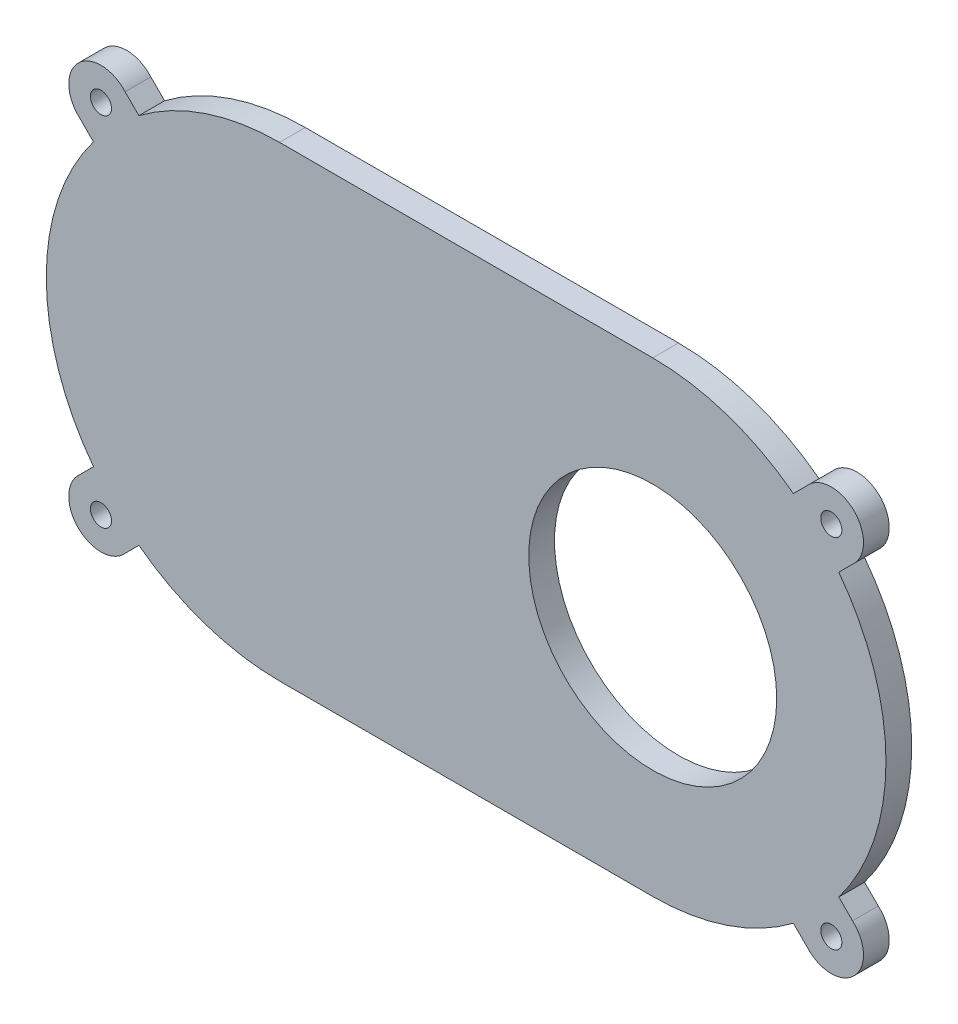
ISO-10303-21;
HEADER;
FILE_DESCRIPTION(('STEP AP214'),'2;1');
FILE_NAME('part.step','',(''),(''),'','','');
FILE_SCHEMA(('AUTOMOTIVE_DESIGN { 1 0 10303 214 1 1 1 1 }'));
ENDSEC;
DATA;
#1=APPLICATION_CONTEXT('core data for automotive mechanical design processes');
#2=APPLICATION_PROTOCOL_DEFINITION('international standard','automotive_design',2000,#1);
#3=PRODUCT_CONTEXT('',#1,'mechanical');
#4=PRODUCT('Part','Part','',(#3));
#5=PRODUCT_RELATED_PRODUCT_CATEGORY('part','',(#4));
#6=PRODUCT_DEFINITION_FORMATION('','',#4);
#7=PRODUCT_DEFINITION_CONTEXT('part definition',#1,'design');
#8=PRODUCT_DEFINITION('design','',#6,#7);
#9=PRODUCT_DEFINITION_SHAPE('','',#8);
#10=(LENGTH_UNIT() NAMED_UNIT(*) SI_UNIT(.MILLI.,.METRE.));
#11=(NAMED_UNIT(*) PLANE_ANGLE_UNIT() SI_UNIT($,.RADIAN.));
#12=(NAMED_UNIT(*) SI_UNIT($,.STERADIAN.) SOLID_ANGLE_UNIT());
#13=UNCERTAINTY_MEASURE_WITH_UNIT(LENGTH_MEASURE(1.E-05),#10,'distance_accuracy_value','');
#14=(GEOMETRIC_REPRESENTATION_CONTEXT(3) GLOBAL_UNCERTAINTY_ASSIGNED_CONTEXT((#13)) GLOBAL_UNIT_ASSIGNED_CONTEXT((#10,
#11,#12)) REPRESENTATION_CONTEXT('',''));
#15=CARTESIAN_POINT('',(0.,0.,0.));
#16=DIRECTION('',(0.,0.,1.));
#17=DIRECTION('',(1.,0.,0.));
#18=AXIS2_PLACEMENT_3D('',#15,#16,#17);
#19=CARTESIAN_POINT('',(26.2752289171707,10.0580179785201,5.08));
#20=DIRECTION('',(0.,0.,1.));
#21=DIRECTION('',(1.,0.,0.));
#22=AXIS2_PLACEMENT_3D('',#19,#20,#21);
#23=PLANE('',#22);
#24=CARTESIAN_POINT('',(135.18273411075,-25.1894872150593,5.08));
#25=DIRECTION('',(0.,0.,1.));
#26=DIRECTION('',(1.,0.,0.));
#27=AXIS2_PLACEMENT_3D('',#24,#25,#26);
#28=CIRCLE('',#27,2.08279999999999);
#29=CARTESIAN_POINT('',(137.26553411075,-25.1894872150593,5.08));
#30=VERTEX_POINT('',#29);
#31=EDGE_CURVE('E399',#30,#30,#28,.T.);
#32=ORIENTED_EDGE('',*,*,#31,.F.);
#33=EDGE_LOOP('',(#32));
#34=FACE_BOUND('',#33,.T.);
#35=CARTESIAN_POINT('',(-8.9722762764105,45.3055231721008,5.08));
#36=DIRECTION('',(0.,0.,1.));
#37=DIRECTION('',(1.,0.,0.));
#38=AXIS2_PLACEMENT_3D('',#35,#36,#37);
#39=CIRCLE('',#38,2.08280000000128);
#40=CARTESIAN_POINT('',(-6.88947627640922,45.3055231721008,5.08));
#41=VERTEX_POINT('',#40);
#42=EDGE_CURVE('E411',#41,#41,#39,.T.);
#43=ORIENTED_EDGE('',*,*,#42,.F.);
#44=EDGE_LOOP('',(#43));
#45=FACE_BOUND('',#44,.T.);
#46=CARTESIAN_POINT('',(26.2752289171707,10.0580179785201,5.08));
#47=DIRECTION('',(0.,0.,1.));
#48=DIRECTION('',(1.,0.,0.));
#49=AXIS2_PLACEMENT_3D('',#46,#47,#48);
#50=CIRCLE('',#49,46.0374998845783);
#51=CARTESIAN_POINT('',(-10.4493274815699,37.8205530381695,5.08));
#52=VERTEX_POINT('',#51);
#53=CARTESIAN_POINT('',(-10.4493274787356,-17.7045170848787,5.08));
#54=VERTEX_POINT('',#53);
#55=EDGE_CURVE('E241',#52,#54,#50,.T.);
#56=ORIENTED_EDGE('',*,*,#55,.T.);
#57=DIRECTION('',(-0.707106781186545,-0.70710678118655,0.));
#58=VECTOR('',#57,1.);
#59=CARTESIAN_POINT('',(-10.4493274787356,-17.7045170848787,5.08));
#60=LINE('',#59,#58);
#61=CARTESIAN_POINT('',(-13.1672915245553,-20.4224811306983,5.08));
#62=VERTEX_POINT('',#61);
#63=EDGE_CURVE('E129',#54,#62,#60,.T.);
#64=ORIENTED_EDGE('',*,*,#63,.T.);
#65=CARTESIAN_POINT('',(-8.97227627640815,-25.1894872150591,5.08));
#66=DIRECTION('',(0.,0.,1.));
#67=DIRECTION('',(1.,0.,0.));
#68=AXIS2_PLACEMENT_3D('',#65,#66,#67);
#69=CIRCLE('',#68,6.34999999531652);
#70=CARTESIAN_POINT('',(-4.2052701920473,-29.3845024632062,5.08));
#71=VERTEX_POINT('',#70);
#72=EDGE_CURVE('E292',#62,#71,#69,.T.);
#73=ORIENTED_EDGE('',*,*,#72,.T.);
#74=DIRECTION('',(0.707106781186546,0.70710678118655,0.));
#75=VECTOR('',#74,1.);
#76=CARTESIAN_POINT('',(-4.2052701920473,-29.3845024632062,5.08));
#77=LINE('',#76,#75);
#78=CARTESIAN_POINT('',(-1.48730614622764,-26.6665384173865,5.08));
#79=VERTEX_POINT('',#78);
#80=EDGE_CURVE('E311',#71,#79,#77,.T.);
#81=ORIENTED_EDGE('',*,*,#80,.T.);
#82=CARTESIAN_POINT('',(26.2752289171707,10.0580179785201,5.08));
#83=DIRECTION('',(0.,0.,1.));
#84=DIRECTION('',(1.,0.,0.));
#85=AXIS2_PLACEMENT_3D('',#82,#83,#84);
#86=CIRCLE('',#85,46.0374998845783);
#87=CARTESIAN_POINT('',(26.2752289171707,-35.9794819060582,5.08));
#88=VERTEX_POINT('',#87);
#89=EDGE_CURVE('E308',#79,#88,#86,.T.);
#90=ORIENTED_EDGE('',*,*,#89,.T.);
#91=DIRECTION('',(1.,0.,0.));
#92=VECTOR('',#91,1.);
#93=CARTESIAN_POINT('',(26.2752289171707,-35.9794819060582,5.08));
#94=LINE('',#93,#92);
#95=CARTESIAN_POINT('',(99.9352289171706,-35.9794819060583,5.08));
#96=VERTEX_POINT('',#95);
#97=EDGE_CURVE('E310',#88,#96,#94,.T.);
#98=ORIENTED_EDGE('',*,*,#97,.T.);
#99=CARTESIAN_POINT('',(99.9352289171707,10.0580179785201,5.08));
#100=DIRECTION('',(0.,0.,1.));
#101=DIRECTION('',(1.,0.,0.));
#102=AXIS2_PLACEMENT_3D('',#99,#100,#101);
#103=CIRCLE('',#102,46.0374998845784);
#104=CARTESIAN_POINT('',(127.69776397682,-26.6665384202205,5.08));
#105=VERTEX_POINT('',#104);
#106=EDGE_CURVE('E313',#96,#105,#103,.T.);
#107=ORIENTED_EDGE('',*,*,#106,.T.);
#108=DIRECTION('',(0.707106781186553,-0.707106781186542,0.));
#109=VECTOR('',#108,1.);
#110=CARTESIAN_POINT('',(127.69776397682,-26.6665384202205,5.08));
#111=LINE('',#110,#109);
#112=CARTESIAN_POINT('',(130.415728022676,-29.3845024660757,5.08));
#113=VERTEX_POINT('',#112);
#114=EDGE_CURVE('E319',#105,#113,#111,.T.);
#115=ORIENTED_EDGE('',*,*,#114,.T.);
#116=CARTESIAN_POINT('',(135.18273411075,-25.1894872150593,5.08));
#117=DIRECTION('',(0.,0.,1.));
#118=DIRECTION('',(1.,0.,0.));
#119=AXIS2_PLACEMENT_3D('',#116,#117,#118);
#120=CIRCLE('',#119,6.35000000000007);
#121=CARTESIAN_POINT('',(139.377749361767,-20.4224811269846,5.08));
#122=VERTEX_POINT('',#121);
#123=EDGE_CURVE('E321',#113,#122,#120,.T.);
#124=ORIENTED_EDGE('',*,*,#123,.T.);
#125=DIRECTION('',(-0.707106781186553,0.707106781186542,0.));
#126=VECTOR('',#125,1.);
#127=CARTESIAN_POINT('',(139.377749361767,-20.4224811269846,5.08));
#128=LINE('',#127,#126);
#129=CARTESIAN_POINT('',(136.659785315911,-17.7045170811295,5.08));
#130=VERTEX_POINT('',#129);
#131=EDGE_CURVE('E323',#122,#130,#128,.T.);
#132=ORIENTED_EDGE('',*,*,#131,.T.);
#133=CARTESIAN_POINT('',(99.9352289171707,10.0580179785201,5.08));
#134=DIRECTION('',(0.,0.,1.));
#135=DIRECTION('',(1.,0.,0.));
#136=AXIS2_PLACEMENT_3D('',#133,#134,#135);
#137=CIRCLE('',#136,46.0374998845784);
#138=CARTESIAN_POINT('',(136.659785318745,37.8205530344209,5.08));
#139=VERTEX_POINT('',#138);
#140=EDGE_CURVE('E325',#130,#139,#137,.T.);
#141=ORIENTED_EDGE('',*,*,#140,.T.);
#142=DIRECTION('',(0.707106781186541,0.707106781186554,0.));
#143=VECTOR('',#142,1.);
#144=CARTESIAN_POINT('',(136.659785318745,37.8205530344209,5.08));
#145=LINE('',#144,#143);
#146=CARTESIAN_POINT('',(139.377749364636,40.5385170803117,5.08));
#147=VERTEX_POINT('',#146);
#148=EDGE_CURVE('E327',#139,#147,#145,.T.);
#149=ORIENTED_EDGE('',*,*,#148,.T.);
#150=CARTESIAN_POINT('',(135.182734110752,45.3055231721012,5.08));
#151=DIRECTION('',(0.,0.,1.));
#152=DIRECTION('',(1.,0.,0.));
#153=AXIS2_PLACEMENT_3D('',#150,#151,#152);
#154=CIRCLE('',#153,6.35000000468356);
#155=CARTESIAN_POINT('',(130.415728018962,49.5005384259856,5.08));
#156=VERTEX_POINT('',#155);
#157=EDGE_CURVE('E329',#147,#156,#154,.T.);
#158=ORIENTED_EDGE('',*,*,#157,.T.);
#159=DIRECTION('',(-0.707106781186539,-0.707106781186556,0.));
#160=VECTOR('',#159,1.);
#161=CARTESIAN_POINT('',(130.415728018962,49.5005384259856,5.08));
#162=LINE('',#161,#160);
#163=CARTESIAN_POINT('',(127.697763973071,46.7825743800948,5.08));
#164=VERTEX_POINT('',#163);
#165=EDGE_CURVE('E331',#156,#164,#162,.T.);
#166=ORIENTED_EDGE('',*,*,#165,.T.);
#167=CARTESIAN_POINT('',(99.9352289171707,10.0580179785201,5.08));
#168=DIRECTION('',(0.,0.,1.));
#169=DIRECTION('',(1.,0.,0.));
#170=AXIS2_PLACEMENT_3D('',#167,#168,#169);
#171=CIRCLE('',#170,46.0374998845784);
#172=CARTESIAN_POINT('',(99.9352289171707,56.0955178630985,5.08));
#173=VERTEX_POINT('',#172);
#174=EDGE_CURVE('E333',#164,#173,#171,.T.);
#175=ORIENTED_EDGE('',*,*,#174,.T.);
#176=DIRECTION('',(-1.,0.,0.));
#177=VECTOR('',#176,1.);
#178=CARTESIAN_POINT('',(99.9352289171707,56.0955178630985,5.08));
#179=LINE('',#178,#177);
#180=CARTESIAN_POINT('',(26.2752289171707,56.0955178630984,5.08));
#181=VERTEX_POINT('',#180);
#182=EDGE_CURVE('E335',#173,#181,#179,.T.);
#183=ORIENTED_EDGE('',*,*,#182,.T.);
#184=CARTESIAN_POINT('',(26.2752289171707,10.0580179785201,5.08));
#185=DIRECTION('',(0.,0.,1.));
#186=DIRECTION('',(1.,0.,0.));
#187=AXIS2_PLACEMENT_3D('',#184,#185,#186);
#188=CIRCLE('',#187,46.0374998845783);
#189=CARTESIAN_POINT('',(-1.48730614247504,46.7825743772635,5.08));
#190=VERTEX_POINT('',#189);
#191=EDGE_CURVE('E184',#181,#190,#188,.T.);
#192=ORIENTED_EDGE('',*,*,#191,.T.);
#193=DIRECTION('',(-0.707106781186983,0.707106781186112,0.));
#194=VECTOR('',#193,1.);
#195=CARTESIAN_POINT('',(-1.48730614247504,46.7825743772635,5.08));
#196=LINE('',#195,#194);
#197=CARTESIAN_POINT('',(-4.20527018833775,49.5005384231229,5.08));
#198=VERTEX_POINT('',#197);
#199=EDGE_CURVE('E178',#190,#198,#196,.T.);
#200=ORIENTED_EDGE('',*,*,#199,.T.);
#201=CARTESIAN_POINT('',(-8.9722762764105,45.3055231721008,5.08));
#202=DIRECTION('',(0.,0.,1.));
#203=DIRECTION('',(1.,0.,0.));
#204=AXIS2_PLACEMENT_3D('',#201,#202,#203);
#205=CIRCLE('',#204,6.35000000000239);
#206=CARTESIAN_POINT('',(-13.1672915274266,40.5385170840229,5.08));
#207=VERTEX_POINT('',#206);
#208=EDGE_CURVE('E182',#198,#207,#205,.T.);
#209=ORIENTED_EDGE('',*,*,#208,.T.);
#210=DIRECTION('',(0.707106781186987,-0.707106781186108,0.));
#211=VECTOR('',#210,1.);
#212=CARTESIAN_POINT('',(-13.1672915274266,40.5385170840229,5.08));
#213=LINE('',#212,#211);
#214=EDGE_CURVE('E50',#207,#52,#213,.T.);
#215=ORIENTED_EDGE('',*,*,#214,.T.);
#216=EDGE_LOOP('',(#56,#64,#73,#81,#90,#98,#107,#115,#124,#132,#141,#149,#158,#166,#175,#183,
#192,#200,#209,#215));
#217=FACE_BOUND('',#216,.T.);
#218=CARTESIAN_POINT('',(-8.97227627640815,-25.1894872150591,5.08));
#219=DIRECTION('',(0.,0.,1.));
#220=DIRECTION('',(1.,0.,0.));
#221=AXIS2_PLACEMENT_3D('',#218,#219,#220);
#222=CIRCLE('',#221,2.08279999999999);
#223=CARTESIAN_POINT('',(-6.88947627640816,-25.1894872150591,5.08));
#224=VERTEX_POINT('',#223);
#225=EDGE_CURVE('E206',#224,#224,#222,.T.);
#226=ORIENTED_EDGE('',*,*,#225,.F.);
#227=EDGE_LOOP('',(#226));
#228=FACE_BOUND('',#227,.T.);
#229=CARTESIAN_POINT('',(135.182734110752,45.3055231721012,5.08));
#230=DIRECTION('',(0.,0.,1.));
#231=DIRECTION('',(1.,0.,0.));
#232=AXIS2_PLACEMENT_3D('',#229,#230,#231);
#233=CIRCLE('',#232,2.08279999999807);
#234=CARTESIAN_POINT('',(137.26553411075,45.3055231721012,5.08));
#235=VERTEX_POINT('',#234);
#236=EDGE_CURVE('E405',#235,#235,#233,.T.);
#237=ORIENTED_EDGE('',*,*,#236,.F.);
#238=EDGE_LOOP('',(#237));
#239=FACE_BOUND('',#238,.T.);
#240=CARTESIAN_POINT('',(99.9352289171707,10.0580179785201,5.08));
#241=DIRECTION('',(0.,0.,1.));
#242=DIRECTION('',(1.,0.,0.));
#243=AXIS2_PLACEMENT_3D('',#240,#241,#242);
#244=CIRCLE('',#243,24.4729000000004);
#245=CARTESIAN_POINT('',(124.408128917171,10.0580179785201,5.08));
#246=VERTEX_POINT('',#245);
#247=EDGE_CURVE('E390',#246,#246,#244,.T.);
#248=ORIENTED_EDGE('',*,*,#247,.F.);
#249=EDGE_LOOP('',(#248));
#250=FACE_BOUND('',#249,.T.);
#251=ADVANCED_FACE('F33',(#34,#45,#217,#228,#239,#250),#23,.T.);
#252=CARTESIAN_POINT('',(26.2752289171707,10.0580179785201,0.));
#253=DIRECTION('',(0.,0.,1.));
#254=DIRECTION('',(1.,0.,0.));
#255=AXIS2_PLACEMENT_3D('',#252,#253,#254);
#256=PLANE('',#255);
#257=CARTESIAN_POINT('',(26.2752289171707,10.0580179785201,0.));
#258=DIRECTION('',(0.,0.,1.));
#259=DIRECTION('',(1.,0.,0.));
#260=AXIS2_PLACEMENT_3D('',#257,#258,#259);
#261=CIRCLE('',#260,46.0374998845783);
#262=CARTESIAN_POINT('',(-10.4493274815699,37.8205530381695,0.));
#263=VERTEX_POINT('',#262);
#264=CARTESIAN_POINT('',(-10.4493274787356,-17.7045170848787,0.));
#265=VERTEX_POINT('',#264);
#266=EDGE_CURVE('E202',#263,#265,#261,.T.);
#267=ORIENTED_EDGE('',*,*,#266,.F.);
#268=DIRECTION('',(0.707106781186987,-0.707106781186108,0.));
#269=VECTOR('',#268,1.);
#270=CARTESIAN_POINT('',(-13.1672915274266,40.5385170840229,0.));
#271=LINE('',#270,#269);
#272=CARTESIAN_POINT('',(-13.1672915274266,40.5385170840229,0.));
#273=VERTEX_POINT('',#272);
#274=EDGE_CURVE('E121',#273,#263,#271,.T.);
#275=ORIENTED_EDGE('',*,*,#274,.F.);
#276=CARTESIAN_POINT('',(-8.9722762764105,45.3055231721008,0.));
#277=DIRECTION('',(0.,0.,1.));
#278=DIRECTION('',(1.,0.,0.));
#279=AXIS2_PLACEMENT_3D('',#276,#277,#278);
#280=CIRCLE('',#279,6.35000000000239);
#281=CARTESIAN_POINT('',(-4.20527018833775,49.5005384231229,0.));
#282=VERTEX_POINT('',#281);
#283=EDGE_CURVE('E115',#282,#273,#280,.T.);
#284=ORIENTED_EDGE('',*,*,#283,.F.);
#285=DIRECTION('',(-0.707106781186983,0.707106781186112,0.));
#286=VECTOR('',#285,1.);
#287=CARTESIAN_POINT('',(-1.48730614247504,46.7825743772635,0.));
#288=LINE('',#287,#286);
#289=CARTESIAN_POINT('',(-1.48730614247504,46.7825743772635,0.));
#290=VERTEX_POINT('',#289);
#291=EDGE_CURVE('E192',#290,#282,#288,.T.);
#292=ORIENTED_EDGE('',*,*,#291,.F.);
#293=CARTESIAN_POINT('',(26.2752289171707,10.0580179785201,0.));
#294=DIRECTION('',(0.,0.,1.));
#295=DIRECTION('',(1.,0.,0.));
#296=AXIS2_PLACEMENT_3D('',#293,#294,#295);
#297=CIRCLE('',#296,46.0374998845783);
#298=CARTESIAN_POINT('',(26.2752289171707,56.0955178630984,0.));
#299=VERTEX_POINT('',#298);
#300=EDGE_CURVE('E236',#299,#290,#297,.T.);
#301=ORIENTED_EDGE('',*,*,#300,.F.);
#302=DIRECTION('',(-1.,0.,0.));
#303=VECTOR('',#302,1.);
#304=CARTESIAN_POINT('',(99.9352289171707,56.0955178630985,0.));
#305=LINE('',#304,#303);
#306=CARTESIAN_POINT('',(99.9352289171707,56.0955178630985,0.));
#307=VERTEX_POINT('',#306);
#308=EDGE_CURVE('E234',#307,#299,#305,.T.);
#309=ORIENTED_EDGE('',*,*,#308,.F.);
#310=CARTESIAN_POINT('',(99.9352289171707,10.0580179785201,0.));
#311=DIRECTION('',(0.,0.,1.));
#312=DIRECTION('',(1.,0.,0.));
#313=AXIS2_PLACEMENT_3D('',#310,#311,#312);
#314=CIRCLE('',#313,46.0374998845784);
#315=CARTESIAN_POINT('',(127.697763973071,46.7825743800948,0.));
#316=VERTEX_POINT('',#315);
#317=EDGE_CURVE('E232',#316,#307,#314,.T.);
#318=ORIENTED_EDGE('',*,*,#317,.F.);
#319=DIRECTION('',(-0.707106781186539,-0.707106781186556,0.));
#320=VECTOR('',#319,1.);
#321=CARTESIAN_POINT('',(130.415728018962,49.5005384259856,0.));
#322=LINE('',#321,#320);
#323=CARTESIAN_POINT('',(130.415728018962,49.5005384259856,0.));
#324=VERTEX_POINT('',#323);
#325=EDGE_CURVE('E230',#324,#316,#322,.T.);
#326=ORIENTED_EDGE('',*,*,#325,.F.);
#327=CARTESIAN_POINT('',(135.182734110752,45.3055231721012,0.));
#328=DIRECTION('',(0.,0.,1.));
#329=DIRECTION('',(1.,0.,0.));
#330=AXIS2_PLACEMENT_3D('',#327,#328,#329);
#331=CIRCLE('',#330,6.35000000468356);
#332=CARTESIAN_POINT('',(139.377749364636,40.5385170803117,0.));
#333=VERTEX_POINT('',#332);
#334=EDGE_CURVE('E228',#333,#324,#331,.T.);
#335=ORIENTED_EDGE('',*,*,#334,.F.);
#336=DIRECTION('',(0.707106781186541,0.707106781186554,0.));
#337=VECTOR('',#336,1.);
#338=CARTESIAN_POINT('',(136.659785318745,37.8205530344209,0.));
#339=LINE('',#338,#337);
#340=CARTESIAN_POINT('',(136.659785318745,37.8205530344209,0.));
#341=VERTEX_POINT('',#340);
#342=EDGE_CURVE('E226',#341,#333,#339,.T.);
#343=ORIENTED_EDGE('',*,*,#342,.F.);
#344=CARTESIAN_POINT('',(99.9352289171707,10.0580179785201,0.));
#345=DIRECTION('',(0.,0.,1.));
#346=DIRECTION('',(1.,0.,0.));
#347=AXIS2_PLACEMENT_3D('',#344,#345,#346);
#348=CIRCLE('',#347,46.0374998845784);
#349=CARTESIAN_POINT('',(136.659785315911,-17.7045170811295,0.));
#350=VERTEX_POINT('',#349);
#351=EDGE_CURVE('E224',#350,#341,#348,.T.);
#352=ORIENTED_EDGE('',*,*,#351,.F.);
#353=DIRECTION('',(-0.707106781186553,0.707106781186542,0.));
#354=VECTOR('',#353,1.);
#355=CARTESIAN_POINT('',(139.377749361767,-20.4224811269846,0.));
#356=LINE('',#355,#354);
#357=CARTESIAN_POINT('',(139.377749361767,-20.4224811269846,0.));
#358=VERTEX_POINT('',#357);
#359=EDGE_CURVE('E222',#358,#350,#356,.T.);
#360=ORIENTED_EDGE('',*,*,#359,.F.);
#361=CARTESIAN_POINT('',(135.18273411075,-25.1894872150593,0.));
#362=DIRECTION('',(0.,0.,1.));
#363=DIRECTION('',(1.,0.,0.));
#364=AXIS2_PLACEMENT_3D('',#361,#362,#363);
#365=CIRCLE('',#364,6.35000000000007);
#366=CARTESIAN_POINT('',(130.415728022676,-29.3845024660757,0.));
#367=VERTEX_POINT('',#366);
#368=EDGE_CURVE('E220',#367,#358,#365,.T.);
#369=ORIENTED_EDGE('',*,*,#368,.F.);
#370=DIRECTION('',(0.707106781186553,-0.707106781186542,0.));
#371=VECTOR('',#370,1.);
#372=CARTESIAN_POINT('',(127.69776397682,-26.6665384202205,0.));
#373=LINE('',#372,#371);
#374=CARTESIAN_POINT('',(127.69776397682,-26.6665384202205,0.));
#375=VERTEX_POINT('',#374);
#376=EDGE_CURVE('E218',#375,#367,#373,.T.);
#377=ORIENTED_EDGE('',*,*,#376,.F.);
#378=CARTESIAN_POINT('',(99.9352289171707,10.0580179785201,0.));
#379=DIRECTION('',(0.,0.,1.));
#380=DIRECTION('',(1.,0.,0.));
#381=AXIS2_PLACEMENT_3D('',#378,#379,#380);
#382=CIRCLE('',#381,46.0374998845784);
#383=CARTESIAN_POINT('',(99.9352289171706,-35.9794819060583,0.));
#384=VERTEX_POINT('',#383);
#385=EDGE_CURVE('E216',#384,#375,#382,.T.);
#386=ORIENTED_EDGE('',*,*,#385,.F.);
#387=DIRECTION('',(1.,0.,0.));
#388=VECTOR('',#387,1.);
#389=CARTESIAN_POINT('',(26.2752289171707,-35.9794819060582,0.));
#390=LINE('',#389,#388);
#391=CARTESIAN_POINT('',(26.2752289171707,-35.9794819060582,0.));
#392=VERTEX_POINT('',#391);
#393=EDGE_CURVE('E214',#392,#384,#390,.T.);
#394=ORIENTED_EDGE('',*,*,#393,.F.);
#395=CARTESIAN_POINT('',(26.2752289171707,10.0580179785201,0.));
#396=DIRECTION('',(0.,0.,1.));
#397=DIRECTION('',(1.,0.,0.));
#398=AXIS2_PLACEMENT_3D('',#395,#396,#397);
#399=CIRCLE('',#398,46.0374998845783);
#400=CARTESIAN_POINT('',(-1.48730614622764,-26.6665384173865,0.));
#401=VERTEX_POINT('',#400);
#402=EDGE_CURVE('E212',#401,#392,#399,.T.);
#403=ORIENTED_EDGE('',*,*,#402,.F.);
#404=DIRECTION('',(0.707106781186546,0.70710678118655,0.));
#405=VECTOR('',#404,1.);
#406=CARTESIAN_POINT('',(-4.2052701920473,-29.3845024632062,0.));
#407=LINE('',#406,#405);
#408=CARTESIAN_POINT('',(-4.2052701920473,-29.3845024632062,0.));
#409=VERTEX_POINT('',#408);
#410=EDGE_CURVE('E210',#409,#401,#407,.T.);
#411=ORIENTED_EDGE('',*,*,#410,.F.);
#412=CARTESIAN_POINT('',(-8.97227627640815,-25.1894872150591,0.));
#413=DIRECTION('',(0.,0.,1.));
#414=DIRECTION('',(1.,0.,0.));
#415=AXIS2_PLACEMENT_3D('',#412,#413,#414);
#416=CIRCLE('',#415,6.34999999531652);
#417=CARTESIAN_POINT('',(-13.1672915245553,-20.4224811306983,0.));
#418=VERTEX_POINT('',#417);
#419=EDGE_CURVE('E208',#418,#409,#416,.T.);
#420=ORIENTED_EDGE('',*,*,#419,.F.);
#421=DIRECTION('',(-0.707106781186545,-0.70710678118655,0.));
#422=VECTOR('',#421,1.);
#423=CARTESIAN_POINT('',(-10.4493274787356,-17.7045170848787,0.));
#424=LINE('',#423,#422);
#425=EDGE_CURVE('E205',#265,#418,#424,.T.);
#426=ORIENTED_EDGE('',*,*,#425,.F.);
#427=EDGE_LOOP('',(#267,#275,#284,#292,#301,#309,#318,#326,#335,#343,#352,#360,#369,#377,#386,
#394,#403,#411,#420,#426));
#428=FACE_BOUND('',#427,.T.);
#429=CARTESIAN_POINT('',(-8.97227627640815,-25.1894872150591,0.));
#430=DIRECTION('',(0.,0.,1.));
#431=DIRECTION('',(1.,0.,0.));
#432=AXIS2_PLACEMENT_3D('',#429,#430,#431);
#433=CIRCLE('',#432,2.08279999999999);
#434=CARTESIAN_POINT('',(-6.88947627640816,-25.1894872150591,0.));
#435=VERTEX_POINT('',#434);
#436=EDGE_CURVE('E414',#435,#435,#433,.T.);
#437=ORIENTED_EDGE('',*,*,#436,.T.);
#438=EDGE_LOOP('',(#437));
#439=FACE_BOUND('',#438,.T.);
#440=CARTESIAN_POINT('',(-8.9722762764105,45.3055231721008,0.));
#441=DIRECTION('',(0.,0.,1.));
#442=DIRECTION('',(1.,0.,0.));
#443=AXIS2_PLACEMENT_3D('',#440,#441,#442);
#444=CIRCLE('',#443,2.08280000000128);
#445=CARTESIAN_POINT('',(-6.88947627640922,45.3055231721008,0.));
#446=VERTEX_POINT('',#445);
#447=EDGE_CURVE('E408',#446,#446,#444,.T.);
#448=ORIENTED_EDGE('',*,*,#447,.T.);
#449=EDGE_LOOP('',(#448));
#450=FACE_BOUND('',#449,.T.);
#451=CARTESIAN_POINT('',(135.182734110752,45.3055231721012,0.));
#452=DIRECTION('',(0.,0.,1.));
#453=DIRECTION('',(1.,0.,0.));
#454=AXIS2_PLACEMENT_3D('',#451,#452,#453);
#455=CIRCLE('',#454,2.08279999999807);
#456=CARTESIAN_POINT('',(137.26553411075,45.3055231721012,0.));
#457=VERTEX_POINT('',#456);
#458=EDGE_CURVE('E402',#457,#457,#455,.T.);
#459=ORIENTED_EDGE('',*,*,#458,.T.);
#460=EDGE_LOOP('',(#459));
#461=FACE_BOUND('',#460,.T.);
#462=CARTESIAN_POINT('',(135.18273411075,-25.1894872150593,0.));
#463=DIRECTION('',(0.,0.,1.));
#464=DIRECTION('',(1.,0.,0.));
#465=AXIS2_PLACEMENT_3D('',#462,#463,#464);
#466=CIRCLE('',#465,2.08279999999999);
#467=CARTESIAN_POINT('',(137.26553411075,-25.1894872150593,0.));
#468=VERTEX_POINT('',#467);
#469=EDGE_CURVE('E396',#468,#468,#466,.T.);
#470=ORIENTED_EDGE('',*,*,#469,.T.);
#471=EDGE_LOOP('',(#470));
#472=FACE_BOUND('',#471,.T.);
#473=CARTESIAN_POINT('',(99.9352289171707,10.0580179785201,0.));
#474=DIRECTION('',(0.,0.,1.));
#475=DIRECTION('',(1.,0.,0.));
#476=AXIS2_PLACEMENT_3D('',#473,#474,#475);
#477=CIRCLE('',#476,24.4729000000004);
#478=CARTESIAN_POINT('',(124.408128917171,10.0580179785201,0.));
#479=VERTEX_POINT('',#478);
#480=EDGE_CURVE('E393',#479,#479,#477,.T.);
#481=ORIENTED_EDGE('',*,*,#480,.T.);
#482=EDGE_LOOP('',(#481));
#483=FACE_BOUND('',#482,.T.);
#484=ADVANCED_FACE('F296',(#428,#439,#450,#461,#472,#483),#256,.F.);
#485=CARTESIAN_POINT('',(26.2752289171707,10.0580179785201,5.08));
#486=DIRECTION('',(0.,0.,-1.));
#487=DIRECTION('',(-1.,0.,0.));
#488=AXIS2_PLACEMENT_3D('',#485,#486,#487);
#489=CYLINDRICAL_SURFACE('',#488,46.0374998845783);
#490=ORIENTED_EDGE('',*,*,#266,.T.);
#491=DIRECTION('',(0.,0.,-1.));
#492=VECTOR('',#491,1.);
#493=CARTESIAN_POINT('',(-10.4493274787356,-17.7045170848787,5.08));
#494=LINE('',#493,#492);
#495=EDGE_CURVE('E11',#54,#265,#494,.T.);
#496=ORIENTED_EDGE('',*,*,#495,.F.);
#497=ORIENTED_EDGE('',*,*,#55,.F.);
#498=DIRECTION('',(0.,0.,-1.));
#499=VECTOR('',#498,1.);
#500=CARTESIAN_POINT('',(-10.4493274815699,37.8205530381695,5.08));
#501=LINE('',#500,#499);
#502=EDGE_CURVE('E198',#52,#263,#501,.T.);
#503=ORIENTED_EDGE('',*,*,#502,.T.);
#504=EDGE_LOOP('',(#490,#496,#497,#503));
#505=FACE_BOUND('',#504,.T.);
#506=ADVANCED_FACE('F35',(#505),#489,.T.);
#507=CARTESIAN_POINT('',(-10.4493274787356,-17.7045170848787,5.08));
#508=DIRECTION('',(0.70710678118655,-0.707106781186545,0.));
#509=DIRECTION('',(0.707106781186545,0.70710678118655,0.));
#510=AXIS2_PLACEMENT_3D('',#507,#508,#509);
#511=PLANE('',#510);
#512=ORIENTED_EDGE('',*,*,#425,.T.);
#513=DIRECTION('',(0.,0.,-1.));
#514=VECTOR('',#513,1.);
#515=CARTESIAN_POINT('',(-13.1672915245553,-20.4224811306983,5.08));
#516=LINE('',#515,#514);
#517=EDGE_CURVE('E42',#62,#418,#516,.T.);
#518=ORIENTED_EDGE('',*,*,#517,.F.);
#519=ORIENTED_EDGE('',*,*,#63,.F.);
#520=ORIENTED_EDGE('',*,*,#495,.T.);
#521=EDGE_LOOP('',(#512,#518,#519,#520));
#522=FACE_BOUND('',#521,.T.);
#523=ADVANCED_FACE('F613',(#522),#511,.F.);
#524=CARTESIAN_POINT('',(-8.97227627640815,-25.1894872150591,5.08));
#525=DIRECTION('',(0.,0.,-1.));
#526=DIRECTION('',(-1.,0.,0.));
#527=AXIS2_PLACEMENT_3D('',#524,#525,#526);
#528=CYLINDRICAL_SURFACE('',#527,6.34999999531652);
#529=ORIENTED_EDGE('',*,*,#419,.T.);
#530=DIRECTION('',(0.,0.,-1.));
#531=VECTOR('',#530,1.);
#532=CARTESIAN_POINT('',(-4.2052701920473,-29.3845024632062,5.08));
#533=LINE('',#532,#531);
#534=EDGE_CURVE('E284',#71,#409,#533,.T.);
#535=ORIENTED_EDGE('',*,*,#534,.F.);
#536=ORIENTED_EDGE('',*,*,#72,.F.);
#537=ORIENTED_EDGE('',*,*,#517,.T.);
#538=EDGE_LOOP('',(#529,#535,#536,#537));
#539=FACE_BOUND('',#538,.T.);
#540=ADVANCED_FACE('F290',(#539),#528,.T.);
#541=CARTESIAN_POINT('',(-4.2052701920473,-29.3845024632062,5.08));
#542=DIRECTION('',(-0.70710678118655,0.707106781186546,0.));
#543=DIRECTION('',(-0.707106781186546,-0.70710678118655,0.));
#544=AXIS2_PLACEMENT_3D('',#541,#542,#543);
#545=PLANE('',#544);
#546=ORIENTED_EDGE('',*,*,#410,.T.);
#547=DIRECTION('',(0.,0.,-1.));
#548=VECTOR('',#547,1.);
#549=CARTESIAN_POINT('',(-1.48730614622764,-26.6665384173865,5.08));
#550=LINE('',#549,#548);
#551=EDGE_CURVE('E281',#79,#401,#550,.T.);
#552=ORIENTED_EDGE('',*,*,#551,.F.);
#553=ORIENTED_EDGE('',*,*,#80,.F.);
#554=ORIENTED_EDGE('',*,*,#534,.T.);
#555=EDGE_LOOP('',(#546,#552,#553,#554));
#556=FACE_BOUND('',#555,.T.);
#557=ADVANCED_FACE('F302',(#556),#545,.F.);
#558=CARTESIAN_POINT('',(26.2752289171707,10.0580179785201,5.08));
#559=DIRECTION('',(0.,0.,-1.));
#560=DIRECTION('',(-1.,0.,0.));
#561=AXIS2_PLACEMENT_3D('',#558,#559,#560);
#562=CYLINDRICAL_SURFACE('',#561,46.0374998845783);
#563=ORIENTED_EDGE('',*,*,#402,.T.);
#564=DIRECTION('',(0.,0.,-1.));
#565=VECTOR('',#564,1.);
#566=CARTESIAN_POINT('',(26.2752289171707,-35.9794819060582,5.08));
#567=LINE('',#566,#565);
#568=EDGE_CURVE('E278',#88,#392,#567,.T.);
#569=ORIENTED_EDGE('',*,*,#568,.F.);
#570=ORIENTED_EDGE('',*,*,#89,.F.);
#571=ORIENTED_EDGE('',*,*,#551,.T.);
#572=EDGE_LOOP('',(#563,#569,#570,#571));
#573=FACE_BOUND('',#572,.T.);
#574=ADVANCED_FACE('F306',(#573),#562,.T.);
#575=CARTESIAN_POINT('',(26.2752289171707,-35.9794819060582,5.08));
#576=DIRECTION('',(0.,1.,0.));
#577=DIRECTION('',(-1.,0.,0.));
#578=AXIS2_PLACEMENT_3D('',#575,#576,#577);
#579=PLANE('',#578);
#580=ORIENTED_EDGE('',*,*,#393,.T.);
#581=DIRECTION('',(0.,0.,-1.));
#582=VECTOR('',#581,1.);
#583=CARTESIAN_POINT('',(99.9352289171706,-35.9794819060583,5.08));
#584=LINE('',#583,#582);
#585=EDGE_CURVE('E275',#96,#384,#584,.T.);
#586=ORIENTED_EDGE('',*,*,#585,.F.);
#587=ORIENTED_EDGE('',*,*,#97,.F.);
#588=ORIENTED_EDGE('',*,*,#568,.T.);
#589=EDGE_LOOP('',(#580,#586,#587,#588));
#590=FACE_BOUND('',#589,.T.);
#591=ADVANCED_FACE('F578',(#590),#579,.F.);
#592=CARTESIAN_POINT('',(99.9352289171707,10.0580179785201,5.08));
#593=DIRECTION('',(0.,0.,-1.));
#594=DIRECTION('',(-1.,0.,0.));
#595=AXIS2_PLACEMENT_3D('',#592,#593,#594);
#596=CYLINDRICAL_SURFACE('',#595,46.0374998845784);
#597=ORIENTED_EDGE('',*,*,#385,.T.);
#598=DIRECTION('',(0.,0.,-1.));
#599=VECTOR('',#598,1.);
#600=CARTESIAN_POINT('',(127.69776397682,-26.6665384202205,5.08));
#601=LINE('',#600,#599);
#602=EDGE_CURVE('E272',#105,#375,#601,.T.);
#603=ORIENTED_EDGE('',*,*,#602,.F.);
#604=ORIENTED_EDGE('',*,*,#106,.F.);
#605=ORIENTED_EDGE('',*,*,#585,.T.);
#606=EDGE_LOOP('',(#597,#603,#604,#605));
#607=FACE_BOUND('',#606,.T.);
#608=ADVANCED_FACE('F568',(#607),#596,.T.);
#609=CARTESIAN_POINT('',(127.69776397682,-26.6665384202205,5.08));
#610=DIRECTION('',(0.707106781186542,0.707106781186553,0.));
#611=DIRECTION('',(-0.707106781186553,0.707106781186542,0.));
#612=AXIS2_PLACEMENT_3D('',#609,#610,#611);
#613=PLANE('',#612);
#614=ORIENTED_EDGE('',*,*,#376,.T.);
#615=DIRECTION('',(0.,0.,-1.));
#616=VECTOR('',#615,1.);
#617=CARTESIAN_POINT('',(130.415728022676,-29.3845024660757,5.08));
#618=LINE('',#617,#616);
#619=EDGE_CURVE('E269',#113,#367,#618,.T.);
#620=ORIENTED_EDGE('',*,*,#619,.F.);
#621=ORIENTED_EDGE('',*,*,#114,.F.);
#622=ORIENTED_EDGE('',*,*,#602,.T.);
#623=EDGE_LOOP('',(#614,#620,#621,#622));
#624=FACE_BOUND('',#623,.T.);
#625=ADVANCED_FACE('F558',(#624),#613,.F.);
#626=CARTESIAN_POINT('',(135.18273411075,-25.1894872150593,5.08));
#627=DIRECTION('',(0.,0.,-1.));
#628=DIRECTION('',(-1.,0.,0.));
#629=AXIS2_PLACEMENT_3D('',#626,#627,#628);
#630=CYLINDRICAL_SURFACE('',#629,6.35000000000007);
#631=ORIENTED_EDGE('',*,*,#368,.T.);
#632=DIRECTION('',(0.,0.,-1.));
#633=VECTOR('',#632,1.);
#634=CARTESIAN_POINT('',(139.377749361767,-20.4224811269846,5.08));
#635=LINE('',#634,#633);
#636=EDGE_CURVE('E266',#122,#358,#635,.T.);
#637=ORIENTED_EDGE('',*,*,#636,.F.);
#638=ORIENTED_EDGE('',*,*,#123,.F.);
#639=ORIENTED_EDGE('',*,*,#619,.T.);
#640=EDGE_LOOP('',(#631,#637,#638,#639));
#641=FACE_BOUND('',#640,.T.);
#642=ADVANCED_FACE('F548',(#641),#630,.T.);
#643=CARTESIAN_POINT('',(139.377749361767,-20.4224811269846,5.08));
#644=DIRECTION('',(-0.707106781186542,-0.707106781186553,0.));
#645=DIRECTION('',(0.707106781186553,-0.707106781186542,0.));
#646=AXIS2_PLACEMENT_3D('',#643,#644,#645);
#647=PLANE('',#646);
#648=ORIENTED_EDGE('',*,*,#359,.T.);
#649=DIRECTION('',(0.,0.,-1.));
#650=VECTOR('',#649,1.);
#651=CARTESIAN_POINT('',(136.659785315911,-17.7045170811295,5.08));
#652=LINE('',#651,#650);
#653=EDGE_CURVE('E263',#130,#350,#652,.T.);
#654=ORIENTED_EDGE('',*,*,#653,.F.);
#655=ORIENTED_EDGE('',*,*,#131,.F.);
#656=ORIENTED_EDGE('',*,*,#636,.T.);
#657=EDGE_LOOP('',(#648,#654,#655,#656));
#658=FACE_BOUND('',#657,.T.);
#659=ADVANCED_FACE('F538',(#658),#647,.F.);
#660=CARTESIAN_POINT('',(99.9352289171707,10.0580179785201,5.08));
#661=DIRECTION('',(0.,0.,-1.));
#662=DIRECTION('',(-1.,0.,0.));
#663=AXIS2_PLACEMENT_3D('',#660,#661,#662);
#664=CYLINDRICAL_SURFACE('',#663,46.0374998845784);
#665=ORIENTED_EDGE('',*,*,#351,.T.);
#666=DIRECTION('',(0.,0.,-1.));
#667=VECTOR('',#666,1.);
#668=CARTESIAN_POINT('',(136.659785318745,37.8205530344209,5.08));
#669=LINE('',#668,#667);
#670=EDGE_CURVE('E260',#139,#341,#669,.T.);
#671=ORIENTED_EDGE('',*,*,#670,.F.);
#672=ORIENTED_EDGE('',*,*,#140,.F.);
#673=ORIENTED_EDGE('',*,*,#653,.T.);
#674=EDGE_LOOP('',(#665,#671,#672,#673));
#675=FACE_BOUND('',#674,.T.);
#676=ADVANCED_FACE('F528',(#675),#664,.T.);
#677=CARTESIAN_POINT('',(136.659785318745,37.8205530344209,5.08));
#678=DIRECTION('',(-0.707106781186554,0.707106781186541,0.));
#679=DIRECTION('',(-0.707106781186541,-0.707106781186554,0.));
#680=AXIS2_PLACEMENT_3D('',#677,#678,#679);
#681=PLANE('',#680);
#682=ORIENTED_EDGE('',*,*,#342,.T.);
#683=DIRECTION('',(0.,0.,-1.));
#684=VECTOR('',#683,1.);
#685=CARTESIAN_POINT('',(139.377749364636,40.5385170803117,5.08));
#686=LINE('',#685,#684);
#687=EDGE_CURVE('E257',#147,#333,#686,.T.);
#688=ORIENTED_EDGE('',*,*,#687,.F.);
#689=ORIENTED_EDGE('',*,*,#148,.F.);
#690=ORIENTED_EDGE('',*,*,#670,.T.);
#691=EDGE_LOOP('',(#682,#688,#689,#690));
#692=FACE_BOUND('',#691,.T.);
#693=ADVANCED_FACE('F518',(#692),#681,.F.);
#694=CARTESIAN_POINT('',(135.182734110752,45.3055231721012,5.08));
#695=DIRECTION('',(0.,0.,-1.));
#696=DIRECTION('',(-1.,0.,0.));
#697=AXIS2_PLACEMENT_3D('',#694,#695,#696);
#698=CYLINDRICAL_SURFACE('',#697,6.35000000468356);
#699=ORIENTED_EDGE('',*,*,#334,.T.);
#700=DIRECTION('',(0.,0.,-1.));
#701=VECTOR('',#700,1.);
#702=CARTESIAN_POINT('',(130.415728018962,49.5005384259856,5.08));
#703=LINE('',#702,#701);
#704=EDGE_CURVE('E254',#156,#324,#703,.T.);
#705=ORIENTED_EDGE('',*,*,#704,.F.);
#706=ORIENTED_EDGE('',*,*,#157,.F.);
#707=ORIENTED_EDGE('',*,*,#687,.T.);
#708=EDGE_LOOP('',(#699,#705,#706,#707));
#709=FACE_BOUND('',#708,.T.);
#710=ADVANCED_FACE('F508',(#709),#698,.T.);
#711=CARTESIAN_POINT('',(130.415728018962,49.5005384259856,5.08));
#712=DIRECTION('',(0.707106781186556,-0.707106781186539,0.));
#713=DIRECTION('',(0.707106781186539,0.707106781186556,0.));
#714=AXIS2_PLACEMENT_3D('',#711,#712,#713);
#715=PLANE('',#714);
#716=ORIENTED_EDGE('',*,*,#325,.T.);
#717=DIRECTION('',(0.,0.,-1.));
#718=VECTOR('',#717,1.);
#719=CARTESIAN_POINT('',(127.697763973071,46.7825743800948,5.08));
#720=LINE('',#719,#718);
#721=EDGE_CURVE('E251',#164,#316,#720,.T.);
#722=ORIENTED_EDGE('',*,*,#721,.F.);
#723=ORIENTED_EDGE('',*,*,#165,.F.);
#724=ORIENTED_EDGE('',*,*,#704,.T.);
#725=EDGE_LOOP('',(#716,#722,#723,#724));
#726=FACE_BOUND('',#725,.T.);
#727=ADVANCED_FACE('F498',(#726),#715,.F.);
#728=CARTESIAN_POINT('',(99.9352289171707,10.0580179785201,5.08));
#729=DIRECTION('',(0.,0.,-1.));
#730=DIRECTION('',(-1.,0.,0.));
#731=AXIS2_PLACEMENT_3D('',#728,#729,#730);
#732=CYLINDRICAL_SURFACE('',#731,46.0374998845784);
#733=ORIENTED_EDGE('',*,*,#317,.T.);
#734=DIRECTION('',(0.,0.,-1.));
#735=VECTOR('',#734,1.);
#736=CARTESIAN_POINT('',(99.9352289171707,56.0955178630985,5.08));
#737=LINE('',#736,#735);
#738=EDGE_CURVE('E248',#173,#307,#737,.T.);
#739=ORIENTED_EDGE('',*,*,#738,.F.);
#740=ORIENTED_EDGE('',*,*,#174,.F.);
#741=ORIENTED_EDGE('',*,*,#721,.T.);
#742=EDGE_LOOP('',(#733,#739,#740,#741));
#743=FACE_BOUND('',#742,.T.);
#744=ADVANCED_FACE('F489',(#743),#732,.T.);
#745=CARTESIAN_POINT('',(99.9352289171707,56.0955178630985,5.08));
#746=DIRECTION('',(0.,-1.,0.));
#747=DIRECTION('',(1.,0.,0.));
#748=AXIS2_PLACEMENT_3D('',#745,#746,#747);
#749=PLANE('',#748);
#750=ORIENTED_EDGE('',*,*,#308,.T.);
#751=DIRECTION('',(0.,0.,-1.));
#752=VECTOR('',#751,1.);
#753=CARTESIAN_POINT('',(26.2752289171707,56.0955178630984,5.08));
#754=LINE('',#753,#752);
#755=EDGE_CURVE('E245',#181,#299,#754,.T.);
#756=ORIENTED_EDGE('',*,*,#755,.F.);
#757=ORIENTED_EDGE('',*,*,#182,.F.);
#758=ORIENTED_EDGE('',*,*,#738,.T.);
#759=EDGE_LOOP('',(#750,#756,#757,#758));
#760=FACE_BOUND('',#759,.T.);
#761=ADVANCED_FACE('F341',(#760),#749,.F.);
#762=CARTESIAN_POINT('',(26.2752289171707,10.0580179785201,5.08));
#763=DIRECTION('',(0.,0.,-1.));
#764=DIRECTION('',(-1.,0.,0.));
#765=AXIS2_PLACEMENT_3D('',#762,#763,#764);
#766=CYLINDRICAL_SURFACE('',#765,46.0374998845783);
#767=ORIENTED_EDGE('',*,*,#300,.T.);
#768=DIRECTION('',(0.,0.,-1.));
#769=VECTOR('',#768,1.);
#770=CARTESIAN_POINT('',(-1.48730614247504,46.7825743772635,5.08));
#771=LINE('',#770,#769);
#772=EDGE_CURVE('E193',#190,#290,#771,.T.);
#773=ORIENTED_EDGE('',*,*,#772,.F.);
#774=ORIENTED_EDGE('',*,*,#191,.F.);
#775=ORIENTED_EDGE('',*,*,#755,.T.);
#776=EDGE_LOOP('',(#767,#773,#774,#775));
#777=FACE_BOUND('',#776,.T.);
#778=ADVANCED_FACE('F345',(#777),#766,.T.);
#779=CARTESIAN_POINT('',(-1.48730614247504,46.7825743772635,5.08));
#780=DIRECTION('',(-0.707106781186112,-0.707106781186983,0.));
#781=DIRECTION('',(0.707106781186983,-0.707106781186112,0.));
#782=AXIS2_PLACEMENT_3D('',#779,#780,#781);
#783=PLANE('',#782);
#784=ORIENTED_EDGE('',*,*,#291,.T.);
#785=DIRECTION('',(0.,0.,-1.));
#786=VECTOR('',#785,1.);
#787=CARTESIAN_POINT('',(-4.20527018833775,49.5005384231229,5.08));
#788=LINE('',#787,#786);
#789=EDGE_CURVE('E189',#198,#282,#788,.T.);
#790=ORIENTED_EDGE('',*,*,#789,.F.);
#791=ORIENTED_EDGE('',*,*,#199,.F.);
#792=ORIENTED_EDGE('',*,*,#772,.T.);
#793=EDGE_LOOP('',(#784,#790,#791,#792));
#794=FACE_BOUND('',#793,.T.);
#795=ADVANCED_FACE('F190',(#794),#783,.F.);
#796=CARTESIAN_POINT('',(-8.9722762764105,45.3055231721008,5.08));
#797=DIRECTION('',(0.,0.,-1.));
#798=DIRECTION('',(-1.,0.,0.));
#799=AXIS2_PLACEMENT_3D('',#796,#797,#798);
#800=CYLINDRICAL_SURFACE('',#799,6.35000000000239);
#801=ORIENTED_EDGE('',*,*,#283,.T.);
#802=DIRECTION('',(0.,0.,-1.));
#803=VECTOR('',#802,1.);
#804=CARTESIAN_POINT('',(-13.1672915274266,40.5385170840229,5.08));
#805=LINE('',#804,#803);
#806=EDGE_CURVE('E194',#207,#273,#805,.T.);
#807=ORIENTED_EDGE('',*,*,#806,.F.);
#808=ORIENTED_EDGE('',*,*,#208,.F.);
#809=ORIENTED_EDGE('',*,*,#789,.T.);
#810=EDGE_LOOP('',(#801,#807,#808,#809));
#811=FACE_BOUND('',#810,.T.);
#812=ADVANCED_FACE('F196',(#811),#800,.T.);
#813=CARTESIAN_POINT('',(-13.1672915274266,40.5385170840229,5.08));
#814=DIRECTION('',(0.707106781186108,0.707106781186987,0.));
#815=DIRECTION('',(-0.707106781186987,0.707106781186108,0.));
#816=AXIS2_PLACEMENT_3D('',#813,#814,#815);
#817=PLANE('',#816);
#818=ORIENTED_EDGE('',*,*,#274,.T.);
#819=ORIENTED_EDGE('',*,*,#502,.F.);
#820=ORIENTED_EDGE('',*,*,#214,.F.);
#821=ORIENTED_EDGE('',*,*,#806,.T.);
#822=EDGE_LOOP('',(#818,#819,#820,#821));
#823=FACE_BOUND('',#822,.T.);
#824=ADVANCED_FACE('F349',(#823),#817,.F.);
#825=CARTESIAN_POINT('',(-8.97227627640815,-25.1894872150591,5.08));
#826=DIRECTION('',(0.,0.,-1.));
#827=DIRECTION('',(-1.,0.,0.));
#828=AXIS2_PLACEMENT_3D('',#825,#826,#827);
#829=CYLINDRICAL_SURFACE('',#828,2.08279999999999);
#830=ORIENTED_EDGE('',*,*,#225,.T.);
#831=EDGE_LOOP('',(#830));
#832=FACE_BOUND('',#831,.T.);
#833=ORIENTED_EDGE('',*,*,#436,.F.);
#834=EDGE_LOOP('',(#833));
#835=FACE_BOUND('',#834,.T.);
#836=ADVANCED_FACE('F351',(#832,#835),#829,.F.);
#837=CARTESIAN_POINT('',(-8.9722762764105,45.3055231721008,5.08));
#838=DIRECTION('',(0.,0.,-1.));
#839=DIRECTION('',(-1.,0.,0.));
#840=AXIS2_PLACEMENT_3D('',#837,#838,#839);
#841=CYLINDRICAL_SURFACE('',#840,2.08280000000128);
#842=ORIENTED_EDGE('',*,*,#42,.T.);
#843=EDGE_LOOP('',(#842));
#844=FACE_BOUND('',#843,.T.);
#845=ORIENTED_EDGE('',*,*,#447,.F.);
#846=EDGE_LOOP('',(#845));
#847=FACE_BOUND('',#846,.T.);
#848=ADVANCED_FACE('F357',(#844,#847),#841,.F.);
#849=CARTESIAN_POINT('',(135.182734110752,45.3055231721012,5.08));
#850=DIRECTION('',(0.,0.,-1.));
#851=DIRECTION('',(-1.,0.,0.));
#852=AXIS2_PLACEMENT_3D('',#849,#850,#851);
#853=CYLINDRICAL_SURFACE('',#852,2.08279999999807);
#854=ORIENTED_EDGE('',*,*,#236,.T.);
#855=EDGE_LOOP('',(#854));
#856=FACE_BOUND('',#855,.T.);
#857=ORIENTED_EDGE('',*,*,#458,.F.);
#858=EDGE_LOOP('',(#857));
#859=FACE_BOUND('',#858,.T.);
#860=ADVANCED_FACE('F373',(#856,#859),#853,.F.);
#861=CARTESIAN_POINT('',(135.18273411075,-25.1894872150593,5.08));
#862=DIRECTION('',(0.,0.,-1.));
#863=DIRECTION('',(-1.,0.,0.));
#864=AXIS2_PLACEMENT_3D('',#861,#862,#863);
#865=CYLINDRICAL_SURFACE('',#864,2.08279999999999);
#866=ORIENTED_EDGE('',*,*,#31,.T.);
#867=EDGE_LOOP('',(#866));
#868=FACE_BOUND('',#867,.T.);
#869=ORIENTED_EDGE('',*,*,#469,.F.);
#870=EDGE_LOOP('',(#869));
#871=FACE_BOUND('',#870,.T.);
#872=ADVANCED_FACE('F377',(#868,#871),#865,.F.);
#873=CARTESIAN_POINT('',(99.9352289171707,10.0580179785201,5.08));
#874=DIRECTION('',(0.,0.,-1.));
#875=DIRECTION('',(-1.,0.,0.));
#876=AXIS2_PLACEMENT_3D('',#873,#874,#875);
#877=CYLINDRICAL_SURFACE('',#876,24.4729000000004);
#878=ORIENTED_EDGE('',*,*,#247,.T.);
#879=EDGE_LOOP('',(#878));
#880=FACE_BOUND('',#879,.T.);
#881=ORIENTED_EDGE('',*,*,#480,.F.);
#882=EDGE_LOOP('',(#881));
#883=FACE_BOUND('',#882,.T.);
#884=ADVANCED_FACE('F381',(#880,#883),#877,.F.);
#885=CLOSED_SHELL('',(#251,#484,#506,#523,#540,#557,#574,#591,#608,#625,#642,#659,#676,#693,
#710,#727,#744,#761,#778,#795,#812,#824,#836,#848,#860,#872,#884));
#886=MANIFOLD_SOLID_BREP('B2',#885);
#887=ADVANCED_BREP_SHAPE_REPRESENTATION('',(#18,#886),#14);
#888=SHAPE_DEFINITION_REPRESENTATION(#9,#887);
ENDSEC;
END-ISO-10303-21;
